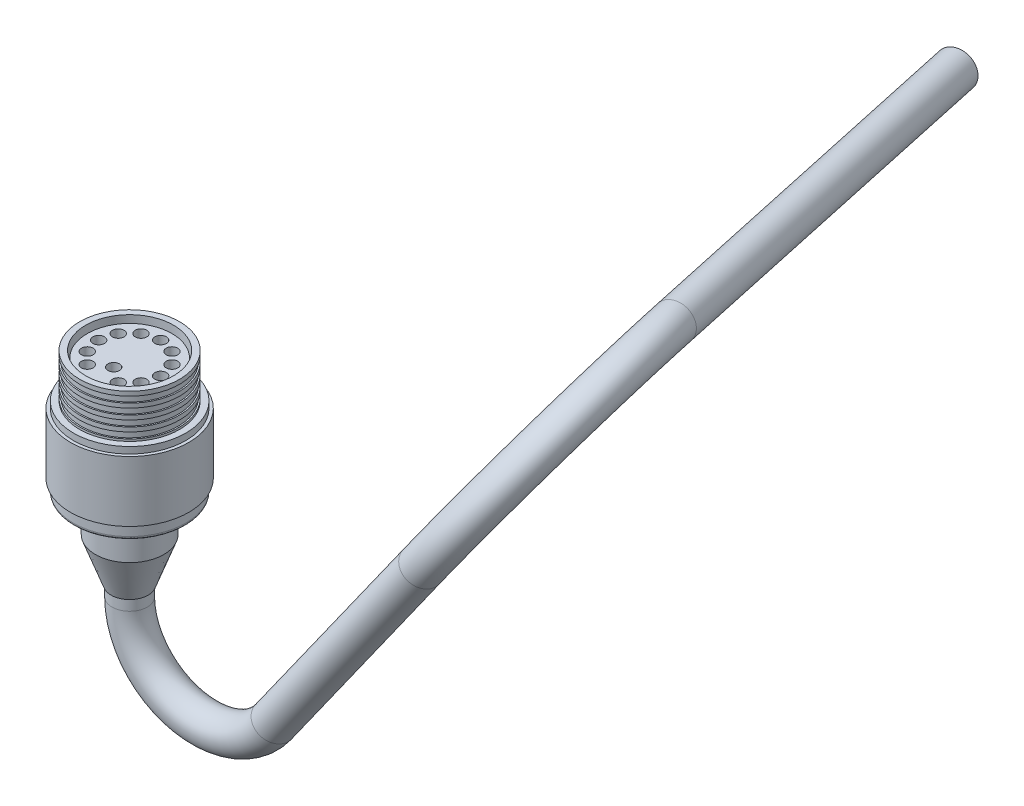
from build123d import *

# Parameters (mm, degrees)
SKETCH1_R           = 10.0965
EXTRUDE1_DEPTH      = 17.145
SKETCH3_R           = 12.5
EXTRUDE3_DEPTH      = 28
SKETCH12_R          = 10.0965
BOSS_EXTRUDE1_DEPTH = 12.7
BOSS_EXTRUDE1_TAPER = 20
SKETCH13_R          = 5.207
BOSS_EXTRUDE2_DEPTH = 3.175
SKETCH7_R           = 1.7145
EXTRUDE5_DEPTH      = 12
CIRPATTERN1_COUNT   = 12
SKETCH8_R           = 1.7145
EXTRUDE6_DEPTH      = 12
SKETCH15_R          = 5.207
REVOLVE2_ANGLE      = 145
SKETCH16_R          = 5.207
BOSS_EXTRUDE3_DEPTH = 72.23125
SKETCH17_R          = 5.207
REVOLVE3_ANGLE      = 99
SKETCH18_R          = 5.207
BOSS_EXTRUDE4_DEPTH = 115.8875


with BuildPart() as part:
    # Sketch1 → Extrude1 (new body)
    with BuildSketch(Plane(origin=(0, 0, 0), x_dir=(1, 0, 0), z_dir=(0, 1, 0))):
        with Locations(Location((0, 0, 0), (0, 0, 270))):
            Circle(SKETCH1_R)
    extrude(amount=EXTRUDE1_DEPTH)

    # Sketch3 → Extrude3 (add)
    with BuildSketch(Plane(origin=(0, 17.145, 0), x_dir=(-1, 0, 0), z_dir=(0, 1, 0))):
        with Locations(Location((0, 0, 0), (0, 0, 90))):
            Circle(SKETCH3_R)
    extrude(amount=EXTRUDE3_DEPTH)

    # Sketch12 → Boss-Extrude1 (add)
    with BuildSketch(Plane.XZ):
        with Locations(Location((0, 0, 0), (0, 0, 270))):
            Circle(SKETCH12_R)
    extrude(amount=BOSS_EXTRUDE1_DEPTH, taper=BOSS_EXTRUDE1_TAPER)

    # Sketch13 → Boss-Extrude2 (add)
    with BuildSketch(Plane.XZ.offset(12.7)):
        with Locations(Location((0, 0, 0), (0, 0, 270))):
            Circle(SKETCH13_R)
    extrude(amount=BOSS_EXTRUDE2_DEPTH)

    # Sketch7 → Extrude5 (cut)
    with BuildSketch(Plane(origin=(0, 45.145, 0), x_dir=(1, 0, 0), z_dir=(0, 1, 0))):
        with Locations(Location((0, 9.144, 0), (0, 0, 270))):
            Circle(SKETCH7_R)
    extrude5 = extrude(amount=-EXTRUDE5_DEPTH, mode=Mode.SUBTRACT)

    # CirPattern1: Extrude5 ×12 about axis, 1 skipped
    cirpattern1_axis = Axis((0, 0, 0), (0, -1, 0))
    add([extrude5.rotate(cirpattern1_axis, i * 360 / CIRPATTERN1_COUNT) for i in range(1, CIRPATTERN1_COUNT) if i not in (6,)], mode=Mode.SUBTRACT)

    # Sketch8 → Extrude6 (cut)
    with BuildSketch(Plane(origin=(0, 45.145, 0), x_dir=(1, 0, 0), z_dir=(0, 1, 0))):
        with Locations(Location((0, -4.689778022, 0), (0, 0, 270))):
            Circle(SKETCH8_R)
    extrude(amount=-EXTRUDE6_DEPTH, mode=Mode.SUBTRACT)

    # Sketch15 → Revolve2 (revolve)
    with BuildSketch(Plane.XZ.offset(15.875)):
        with Locations(Location((0, 0, 0), (0, 0, 177))):
            Circle(SKETCH15_R)
    revolve(axis=Axis((23.752007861, -15.875, 28.555063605), (0.052335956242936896, 0, 0.9986295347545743)), revolution_arc=REVOLVE2_ANGLE)

    # Sketch16 → Boss-Extrude3 (add)
    with BuildSketch(Plane(origin=(-0.146807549, -0.209950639, 0.007693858), x_dir=(0.8196684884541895, -0.5727134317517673, 0.011953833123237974), z_dir=(0.5727903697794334, 0.8191520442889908, -0.030018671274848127))):
        with Locations(Location((49.461647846, 2.716345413, 0), (0, 0, 3.143424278))):
            Circle(SKETCH16_R)
    extrude(amount=BOSS_EXTRUDE3_DEPTH)

    # Sketch17 → Revolve3 (revolve)
    with BuildSketch(Plane(origin=(41.226556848, 58.95842546, -2.160592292), x_dir=(0.8195678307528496, -0.5716502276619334, 0.03904597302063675), z_dir=(0.5727903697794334, 0.8191520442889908, -0.030018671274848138))):
        with Locations(Location((49.369825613, 4.056286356, 0), (0, 0, 4.696942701))):
            Circle(SKETCH17_R)
    revolve(axis=Axis((58.173174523, 45.412455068, -48.443451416), (-0.8034580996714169, 0.5683173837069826, 0.17739907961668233)), revolution_arc=REVOLVE3_ANGLE)

    # Sketch18 → Boss-Extrude4 (add)
    with BuildSketch(Plane(origin=(-7.487716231, -1.545694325, -28.960811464), x_dir=(-0.7413487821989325, -0.6321326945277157, 0.2254112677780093), z_dir=(-0.24998197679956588, -0.051603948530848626, -0.9668743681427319))):
        with Locations(Location((-134.690968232, -12.33684355, 0), (0, 0, 163.955823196))):
            Circle(SKETCH18_R)
    extrude(amount=BOSS_EXTRUDE4_DEPTH)


with BuildPart() as body_2:
    # Sketch9 → DLSA-M Revolve (revolve)
    with BuildSketch(Plane.XY, mode=Mode.PRIVATE) as dlsa_m_revolve_sk:
        with BuildLine():
            Line((12.954, 14.563178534), (11.6205, 14.563178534))
            Line((11.6205, 14.563178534), (11.6205, 15.444023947))
            Line((11.6205, 15.444023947), (12.954, 15.444023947))
            Line((12.954, 15.444023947), (12.954, 47.075178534))
            Line((12.954, 47.075178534), (14.732, 47.075178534))
            Line((14.732, 47.075178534), (14.732, 45.805178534))
            Line((14.732, 45.805178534), (14.32434519, 45.805178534))
            Line((14.32434519, 45.805178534), (14.32434519, 44.027178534))
            Line((14.32434519, 44.027178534), (14.732, 44.027178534))
            Line((14.732, 44.027178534), (14.732, 42.757178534))
            Line((14.732, 42.757178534), (14.32434519, 42.757178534))
            Line((14.32434519, 42.757178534), (14.32434519, 40.979178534))
            Line((14.32434519, 40.979178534), (14.732, 40.979178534))
            Line((14.732, 40.979178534), (14.732, 39.709178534))
            Line((14.732, 39.709178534), (14.32434519, 39.709178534))
            Line((14.32434519, 39.709178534), (14.32434519, 37.931178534))
            Line((14.32434519, 37.931178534), (14.732, 37.931178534))
            Line((14.732, 37.931178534), (14.732, 36.661178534))
            Line((14.732, 36.661178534), (14.32434519, 36.661178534))
            Line((14.32434519, 36.661178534), (14.32434519, 34.883178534))
            Line((14.32434519, 34.883178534), (14.732, 34.883178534))
            Line((14.732, 34.883178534), (14.732, 34.245178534))
            Line((14.732, 34.245178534), (16.5608, 34.245178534))
            Line((16.5608, 34.245178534), (16.5608, 32.320807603))
            Line((16.5608, 32.320807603), (17.4625, 32.320807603))
            Line((17.4625, 32.320807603), (17.4625, 14.447564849))
            Line((17.4625, 14.447564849), (16.5608, 14.447564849))
            Line((16.5608, 14.447564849), (16.5608, 11.245178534))
            ThreePointArc((16.5608, 11.245178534), (16.267906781, 10.538071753), (15.5608, 10.245178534))
            Line((15.5608, 10.245178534), (12.954, 10.245178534))
            Line((12.954, 10.245178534), (12.954, 14.563178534))
        make_face()
    revolve(dlsa_m_revolve_sk.sketch.rotate(Axis((0, 0, 0), (0, -1, 0)), 90), axis=Axis((0, 0, 0), (0, -1, 0)))


solid = Compound([part.part, body_2.part])
